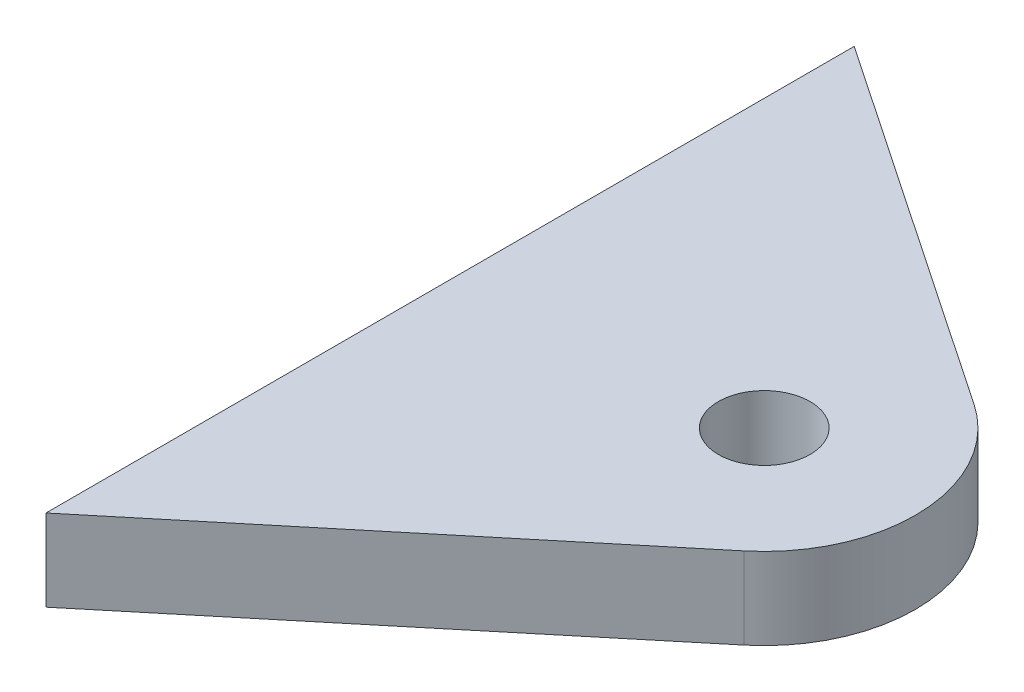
from build123d import *

# Parameters (mm, degrees)
SKETCH1_R           = 14.2875
BOSS_EXTRUDE1_DEPTH = 25.4


with BuildPart() as part:
    # Sketch1 → Boss-Extrude1 (new body)
    with BuildSketch(Plane(origin=(0, 0, 0), x_dir=(1, 0, 0), z_dir=(0, 1, 0))):
        with BuildLine():
            Line((26.361120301, 38.990516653), (-88.9, 116.917472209))
            Line((-88.9, 116.917472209), (-88.9, -134.709261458))
            Line((-88.9, -134.709261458), (30.015456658, -36.252467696))
            ThreePointArc((30.015456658, -36.252467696), (47.0101721, 2.283149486), (26.361120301, 38.990516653))
        make_face()
        with Locations(Location((0, 0, 0), (0, 0, 270))):
            Circle(SKETCH1_R, mode=Mode.SUBTRACT)
    extrude(amount=BOSS_EXTRUDE1_DEPTH)


solid = part.part
